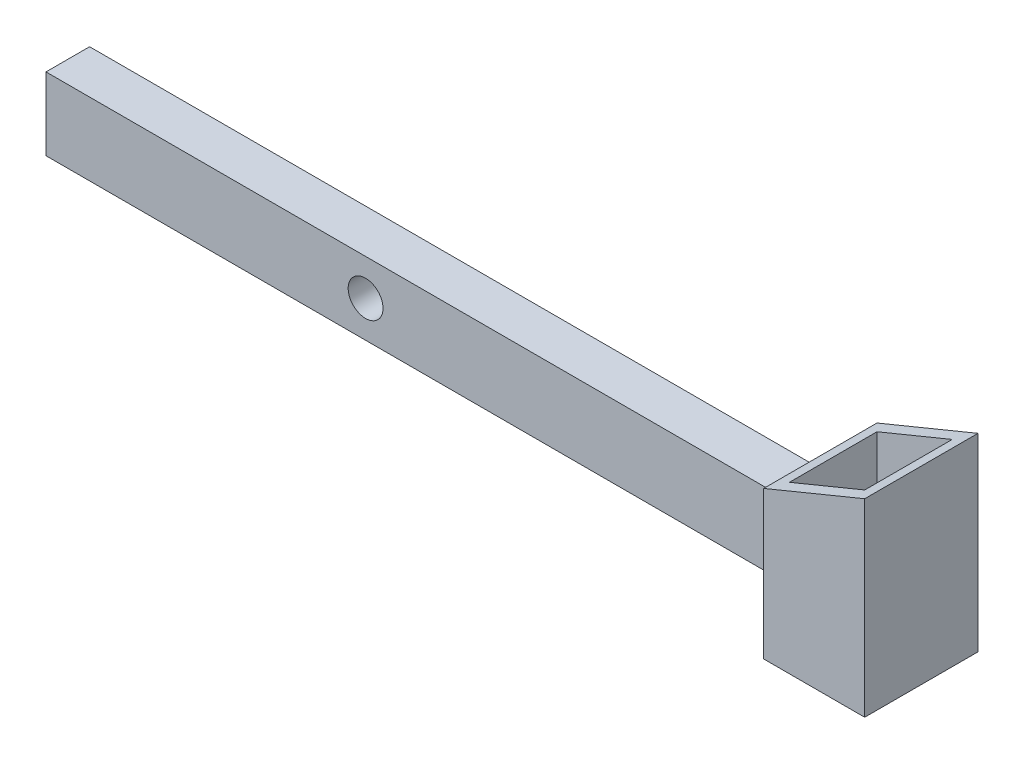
from build123d import *

# Parameters (mm, degrees)
BOSS_EXTRUDE1_DEPTH      = 38
BOSS_EXTRUDE1_DEPTH_BACK = 1
SHELL1_T                 = -4.429346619
SKETCH4_W                = 15
SKETCH4_H                = 25
BOSS_EXTRUDE2_DEPTH      = 260
SKETCH5_R                = 6
CUT_EXTRUDE1_DEPTH       = 50
SKETCH8_R                = 6
CUT_EXTRUDE4_DEPTH       = 20
SKETCH9_R                = 9
CUT_EXTRUDE5_DEPTH       = 5


with BuildPart() as part:
    # Sketch2 → Boss-Extrude1 (new, two sides: drawn at the far end of the back side and taken through both)
    with BuildSketch(Plane.XY.offset(-BOSS_EXTRUDE1_DEPTH_BACK)):
        Polygon((0, 50.830824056), (34.769088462, 65.141232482), (34.769088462, 0), (0, 0), align=None)
    extrude(amount=BOSS_EXTRUDE1_DEPTH + BOSS_EXTRUDE1_DEPTH_BACK)

    # Shell1
    shell1_openings = [part.faces().sort_by_distance(p)[0] for p in [
        (17.384544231, 57.986028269, 18.5),
    ]]
    offset(amount=SHELL1_T, openings=shell1_openings, kind=Kind.INTERSECTION)

    # Sketch4 → Boss-Extrude2 (add)
    with BuildSketch(Plane(origin=(0, -41.5146635, 0), x_dir=(0, 0, 1), z_dir=(-1, 0, 0))):
        with Locations((17.5, 67.5)):
            Rectangle(SKETCH4_W, SKETCH4_H)
    extrude(amount=BOSS_EXTRUDE2_DEPTH)

    # Sketch5 → Cut-Extrude1 (cut)
    with BuildSketch(Plane(origin=(-260, -41.5146635, 0), x_dir=(0, 0, 1), z_dir=(-1, 0, 0))):
        with Locations(Location((17.5, 67.5, 0), (0, 0, 270))):
            Circle(SKETCH5_R)
    extrude(amount=-CUT_EXTRUDE1_DEPTH, mode=Mode.SUBTRACT)

    # Sketch8 → Cut-Extrude4 (cut)
    with BuildSketch(Plane(origin=(0, -41.5146635, 25), x_dir=(1, 0, 0), z_dir=(0, 0, 1))):
        with Locations((-150, 67.5)):
            Circle(SKETCH8_R)
    extrude(amount=-CUT_EXTRUDE4_DEPTH, mode=Mode.SUBTRACT)

    # Sketch9 → Cut-Extrude5 (cut)
    with BuildSketch(Plane(origin=(0, -41.5146635, 10), x_dir=(-1, 0, 0), z_dir=(0, 0, -1))):
        with Locations(Location((150, 67.5, 0), (0, 0, 90))):
            Circle(SKETCH9_R)
    extrude(amount=-CUT_EXTRUDE5_DEPTH, mode=Mode.SUBTRACT)


solid = part.part
